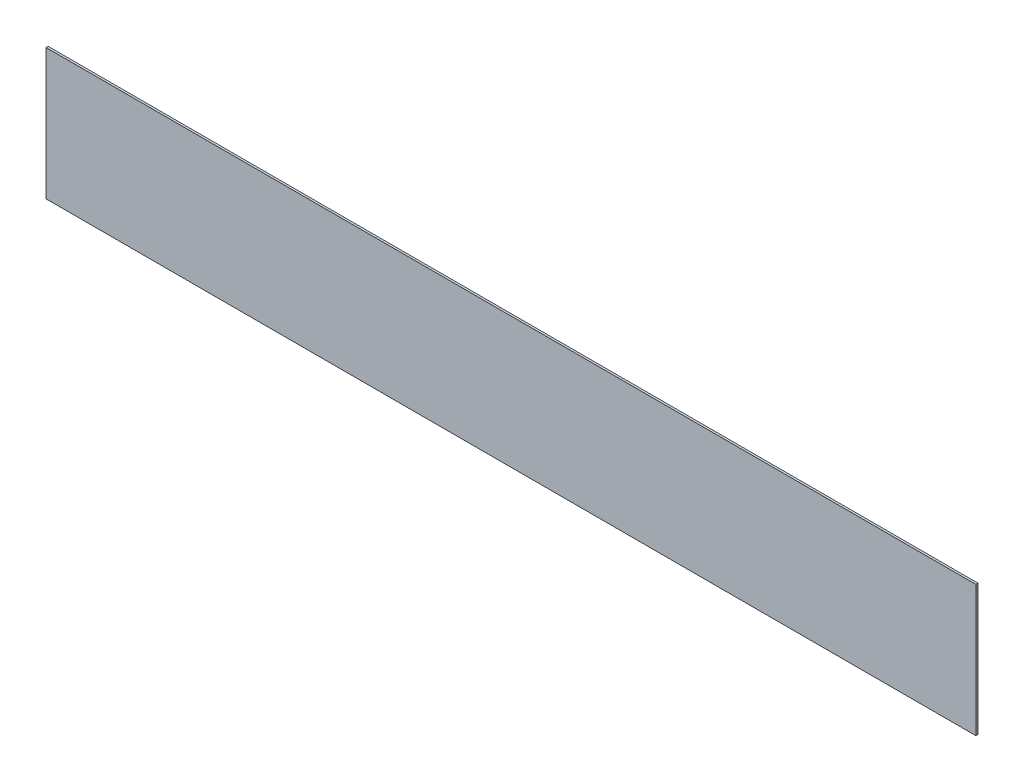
from build123d import *

# Parameters (mm, degrees)
ESQUISSE1_W      = 220
ESQUISSE1_H      = 31
EXTRUSION1_DEPTH = 0.5


with BuildPart() as part:
    # Esquisse1 → Extrusion1 (new body)
    with BuildSketch(Plane.XY):
        with Locations((110, 15.5)):
            Rectangle(ESQUISSE1_W, ESQUISSE1_H)
    extrude(amount=EXTRUSION1_DEPTH)


solid = part.part
